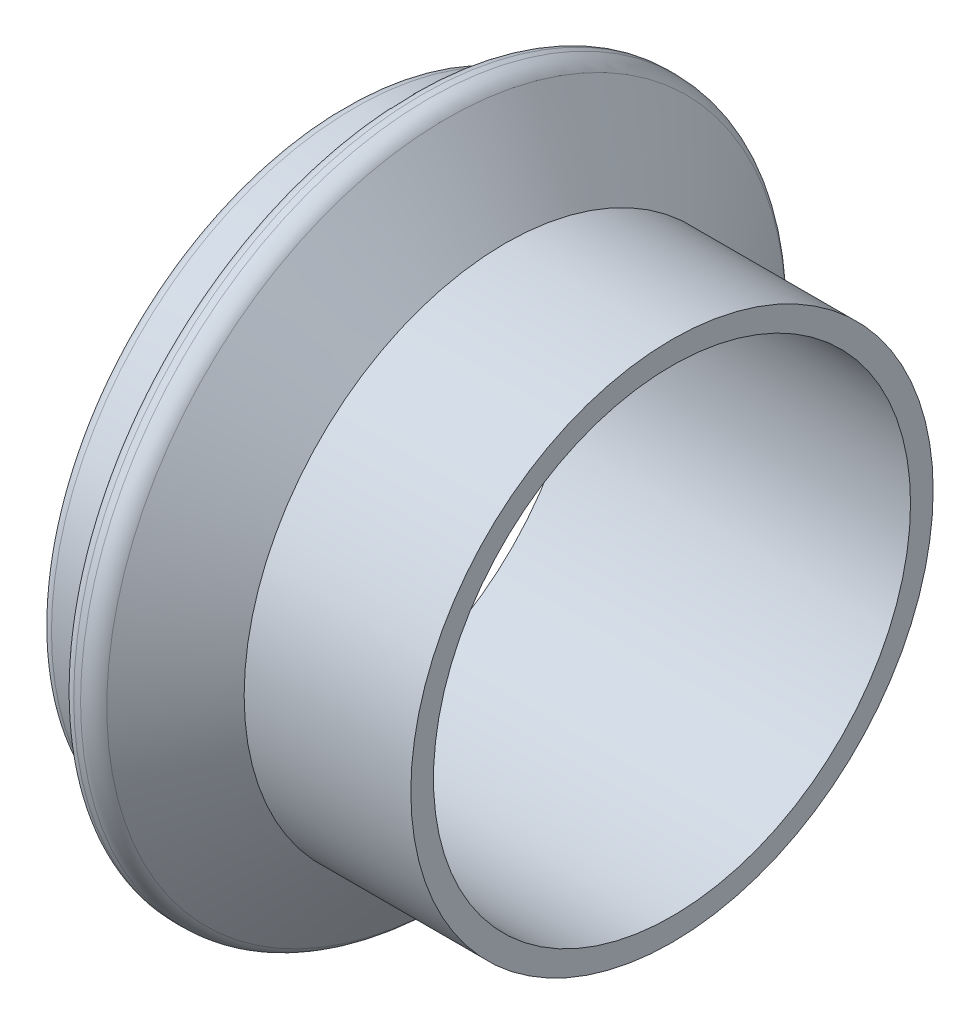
ISO-10303-21;
HEADER;
FILE_DESCRIPTION(('STEP AP214'),'2;1');
FILE_NAME('part.step','',(''),(''),'','','');
FILE_SCHEMA(('AUTOMOTIVE_DESIGN { 1 0 10303 214 1 1 1 1 }'));
ENDSEC;
DATA;
#1=APPLICATION_CONTEXT('core data for automotive mechanical design processes');
#2=APPLICATION_PROTOCOL_DEFINITION('international standard','automotive_design',2000,#1);
#3=PRODUCT_CONTEXT('',#1,'mechanical');
#4=PRODUCT('Part','Part','',(#3));
#5=PRODUCT_RELATED_PRODUCT_CATEGORY('part','',(#4));
#6=PRODUCT_DEFINITION_FORMATION('','',#4);
#7=PRODUCT_DEFINITION_CONTEXT('part definition',#1,'design');
#8=PRODUCT_DEFINITION('design','',#6,#7);
#9=PRODUCT_DEFINITION_SHAPE('','',#8);
#10=(LENGTH_UNIT() NAMED_UNIT(*) SI_UNIT(.MILLI.,.METRE.));
#11=(NAMED_UNIT(*) PLANE_ANGLE_UNIT() SI_UNIT($,.RADIAN.));
#12=(NAMED_UNIT(*) SI_UNIT($,.STERADIAN.) SOLID_ANGLE_UNIT());
#13=UNCERTAINTY_MEASURE_WITH_UNIT(LENGTH_MEASURE(1.E-05),#10,'distance_accuracy_value','');
#14=(GEOMETRIC_REPRESENTATION_CONTEXT(3) GLOBAL_UNCERTAINTY_ASSIGNED_CONTEXT((#13)) GLOBAL_UNIT_ASSIGNED_CONTEXT((#10,
#11,#12)) REPRESENTATION_CONTEXT('',''));
#15=CARTESIAN_POINT('',(0.,0.,0.));
#16=DIRECTION('',(0.,0.,1.));
#17=DIRECTION('',(1.,0.,0.));
#18=AXIS2_PLACEMENT_3D('',#15,#16,#17);
#19=CARTESIAN_POINT('',(0.751416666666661,19.05,0.));
#20=DIRECTION('',(1.,0.,0.));
#21=DIRECTION('',(0.,0.,-1.));
#22=AXIS2_PLACEMENT_3D('',#19,#20,#21);
#23=PLANE('',#22);
#24=CARTESIAN_POINT('',(0.751416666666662,0.,0.));
#25=DIRECTION('',(1.,0.,0.));
#26=DIRECTION('',(0.,0.,-1.));
#27=AXIS2_PLACEMENT_3D('',#24,#25,#26);
#28=CIRCLE('',#27,19.05);
#29=CARTESIAN_POINT('',(0.751416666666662,0.,-19.05));
#30=VERTEX_POINT('',#29);
#31=EDGE_CURVE('E10',#30,#30,#28,.T.);
#32=ORIENTED_EDGE('',*,*,#31,.T.);
#33=EDGE_LOOP('',(#32));
#34=FACE_BOUND('',#33,.T.);
#35=CARTESIAN_POINT('',(0.751416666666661,0.,0.));
#36=DIRECTION('',(1.,0.,0.));
#37=DIRECTION('',(0.,0.,-1.));
#38=AXIS2_PLACEMENT_3D('',#35,#36,#37);
#39=CIRCLE('',#38,17.399);
#40=CARTESIAN_POINT('',(0.751416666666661,0.,-17.399));
#41=VERTEX_POINT('',#40);
#42=EDGE_CURVE('E71',#41,#41,#39,.T.);
#43=ORIENTED_EDGE('',*,*,#42,.F.);
#44=EDGE_LOOP('',(#43));
#45=FACE_BOUND('',#44,.T.);
#46=ADVANCED_FACE('F31',(#34,#45),#23,.T.);
#47=CARTESIAN_POINT('',(0.,0.,0.));
#48=DIRECTION('',(1.,0.,0.));
#49=DIRECTION('',(0.,0.,-1.));
#50=AXIS2_PLACEMENT_3D('',#47,#48,#49);
#51=CYLINDRICAL_SURFACE('',#50,19.05);
#52=CARTESIAN_POINT('',(-11.4053151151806,0.,0.));
#53=DIRECTION('',(1.,0.,0.));
#54=DIRECTION('',(0.,0.,-1.));
#55=AXIS2_PLACEMENT_3D('',#52,#53,#54);
#56=CIRCLE('',#55,19.05);
#57=CARTESIAN_POINT('',(-11.4053151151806,0.,-19.05));
#58=VERTEX_POINT('',#57);
#59=EDGE_CURVE('E37',#58,#58,#56,.T.);
#60=ORIENTED_EDGE('',*,*,#59,.T.);
#61=EDGE_LOOP('',(#60));
#62=FACE_BOUND('',#61,.T.);
#63=ORIENTED_EDGE('',*,*,#31,.F.);
#64=EDGE_LOOP('',(#63));
#65=FACE_BOUND('',#64,.T.);
#66=ADVANCED_FACE('F79',(#62,#65),#51,.T.);
#67=CARTESIAN_POINT('',(-11.4053151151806,0.,0.));
#68=DIRECTION('',(-1.,0.,0.));
#69=DIRECTION('',(0.,0.,1.));
#70=AXIS2_PLACEMENT_3D('',#67,#68,#69);
#71=CONICAL_SURFACE('',#70,19.05,0.925024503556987);
#72=CARTESIAN_POINT('',(-15.7102370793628,0.,0.));
#73=DIRECTION('',(1.,0.,0.));
#74=DIRECTION('',(0.,0.,-1.));
#75=AXIS2_PLACEMENT_3D('',#72,#73,#74);
#76=CIRCLE('',#75,24.7628244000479);
#77=CARTESIAN_POINT('',(-15.7102370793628,0.,-24.7628244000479));
#78=VERTEX_POINT('',#77);
#79=EDGE_CURVE('E41',#78,#78,#76,.T.);
#80=ORIENTED_EDGE('',*,*,#79,.T.);
#81=EDGE_LOOP('',(#80));
#82=FACE_BOUND('',#81,.T.);
#83=ORIENTED_EDGE('',*,*,#59,.F.);
#84=EDGE_LOOP('',(#83));
#85=FACE_BOUND('',#84,.T.);
#86=ADVANCED_FACE('F83',(#82,#85),#71,.T.);
#87=CARTESIAN_POINT('',(-16.9882136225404,0.,0.));
#88=DIRECTION('',(1.,0.,0.));
#89=DIRECTION('',(0.,0.,-1.));
#90=AXIS2_PLACEMENT_3D('',#87,#88,#89);
#91=TOROIDAL_SURFACE('',#90,23.7998,1.60019999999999);
#92=CARTESIAN_POINT('',(-16.9882136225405,0.,0.));
#93=DIRECTION('',(1.,0.,0.));
#94=DIRECTION('',(0.,0.,-1.));
#95=AXIS2_PLACEMENT_3D('',#92,#93,#94);
#96=CIRCLE('',#95,25.4);
#97=CARTESIAN_POINT('',(-16.9882136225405,0.,-25.4));
#98=VERTEX_POINT('',#97);
#99=EDGE_CURVE('E45',#98,#98,#96,.T.);
#100=ORIENTED_EDGE('',*,*,#99,.T.);
#101=EDGE_LOOP('',(#100));
#102=FACE_BOUND('',#101,.T.);
#103=ORIENTED_EDGE('',*,*,#79,.F.);
#104=EDGE_LOOP('',(#103));
#105=FACE_BOUND('',#104,.T.);
#106=ADVANCED_FACE('F87',(#102,#105),#91,.T.);
#107=CARTESIAN_POINT('',(0.,0.,0.));
#108=DIRECTION('',(1.,0.,0.));
#109=DIRECTION('',(0.,0.,-1.));
#110=AXIS2_PLACEMENT_3D('',#107,#108,#109);
#111=CYLINDRICAL_SURFACE('',#110,25.4);
#112=CARTESIAN_POINT('',(-17.4857833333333,0.,0.));
#113=DIRECTION('',(1.,0.,0.));
#114=DIRECTION('',(0.,0.,-1.));
#115=AXIS2_PLACEMENT_3D('',#112,#113,#114);
#116=CIRCLE('',#115,25.4);
#117=CARTESIAN_POINT('',(-17.4857833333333,0.,-25.4));
#118=VERTEX_POINT('',#117);
#119=EDGE_CURVE('E50',#118,#118,#116,.T.);
#120=ORIENTED_EDGE('',*,*,#119,.T.);
#121=EDGE_LOOP('',(#120));
#122=FACE_BOUND('',#121,.T.);
#123=ORIENTED_EDGE('',*,*,#99,.F.);
#124=EDGE_LOOP('',(#123));
#125=FACE_BOUND('',#124,.T.);
#126=ADVANCED_FACE('F94',(#122,#125),#111,.T.);
#127=CARTESIAN_POINT('',(-17.4857833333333,0.,0.));
#128=DIRECTION('',(1.,0.,0.));
#129=DIRECTION('',(0.,0.,-1.));
#130=AXIS2_PLACEMENT_3D('',#127,#128,#129);
#131=TOROIDAL_SURFACE('',#130,24.5872,0.812799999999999);
#132=CARTESIAN_POINT('',(-18.2985833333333,0.,0.));
#133=DIRECTION('',(1.,0.,0.));
#134=DIRECTION('',(0.,0.,-1.));
#135=AXIS2_PLACEMENT_3D('',#132,#133,#134);
#136=CIRCLE('',#135,24.5872);
#137=CARTESIAN_POINT('',(-18.2985833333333,0.,-24.5872));
#138=VERTEX_POINT('',#137);
#139=EDGE_CURVE('E53',#138,#138,#136,.T.);
#140=ORIENTED_EDGE('',*,*,#139,.T.);
#141=EDGE_LOOP('',(#140));
#142=FACE_BOUND('',#141,.T.);
#143=ORIENTED_EDGE('',*,*,#119,.F.);
#144=EDGE_LOOP('',(#143));
#145=FACE_BOUND('',#144,.T.);
#146=ADVANCED_FACE('F98',(#142,#145),#131,.T.);
#147=CARTESIAN_POINT('',(-18.2985833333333,22.8854,0.));
#148=DIRECTION('',(-1.,0.,0.));
#149=DIRECTION('',(0.,0.,1.));
#150=AXIS2_PLACEMENT_3D('',#147,#148,#149);
#151=PLANE('',#150);
#152=CARTESIAN_POINT('',(-18.2985833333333,0.,0.));
#153=DIRECTION('',(1.,0.,0.));
#154=DIRECTION('',(0.,0.,-1.));
#155=AXIS2_PLACEMENT_3D('',#152,#153,#154);
#156=CIRCLE('',#155,22.8854);
#157=CARTESIAN_POINT('',(-18.2985833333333,0.,-22.8854));
#158=VERTEX_POINT('',#157);
#159=EDGE_CURVE('E56',#158,#158,#156,.T.);
#160=ORIENTED_EDGE('',*,*,#159,.T.);
#161=EDGE_LOOP('',(#160));
#162=FACE_BOUND('',#161,.T.);
#163=ORIENTED_EDGE('',*,*,#139,.F.);
#164=EDGE_LOOP('',(#163));
#165=FACE_BOUND('',#164,.T.);
#166=ADVANCED_FACE('F102',(#162,#165),#151,.T.);
#167=CARTESIAN_POINT('',(-19.1113833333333,0.,0.));
#168=DIRECTION('',(1.,0.,0.));
#169=DIRECTION('',(0.,0.,-1.));
#170=AXIS2_PLACEMENT_3D('',#167,#168,#169);
#171=TOROIDAL_SURFACE('',#170,22.8854,0.812799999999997);
#172=CARTESIAN_POINT('',(-19.1113833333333,0.,0.));
#173=DIRECTION('',(1.,0.,0.));
#174=DIRECTION('',(0.,0.,-1.));
#175=AXIS2_PLACEMENT_3D('',#172,#173,#174);
#176=CIRCLE('',#175,22.0726);
#177=CARTESIAN_POINT('',(-19.1113833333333,0.,-22.0726));
#178=VERTEX_POINT('',#177);
#179=EDGE_CURVE('E59',#178,#178,#176,.T.);
#180=ORIENTED_EDGE('',*,*,#179,.T.);
#181=EDGE_LOOP('',(#180));
#182=FACE_BOUND('',#181,.T.);
#183=ORIENTED_EDGE('',*,*,#159,.F.);
#184=EDGE_LOOP('',(#183));
#185=FACE_BOUND('',#184,.T.);
#186=ADVANCED_FACE('F106',(#182,#185),#171,.F.);
#187=CARTESIAN_POINT('',(0.,0.,0.));
#188=DIRECTION('',(1.,0.,0.));
#189=DIRECTION('',(0.,0.,-1.));
#190=AXIS2_PLACEMENT_3D('',#187,#188,#189);
#191=CYLINDRICAL_SURFACE('',#190,22.0726);
#192=CARTESIAN_POINT('',(-22.4387833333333,0.,0.));
#193=DIRECTION('',(1.,0.,0.));
#194=DIRECTION('',(0.,0.,-1.));
#195=AXIS2_PLACEMENT_3D('',#192,#193,#194);
#196=CIRCLE('',#195,22.0726);
#197=CARTESIAN_POINT('',(-22.4387833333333,0.,-22.0726));
#198=VERTEX_POINT('',#197);
#199=EDGE_CURVE('E62',#198,#198,#196,.T.);
#200=ORIENTED_EDGE('',*,*,#199,.T.);
#201=EDGE_LOOP('',(#200));
#202=FACE_BOUND('',#201,.T.);
#203=ORIENTED_EDGE('',*,*,#179,.F.);
#204=EDGE_LOOP('',(#203));
#205=FACE_BOUND('',#204,.T.);
#206=ADVANCED_FACE('F110',(#202,#205),#191,.T.);
#207=CARTESIAN_POINT('',(-22.4387833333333,0.,0.));
#208=DIRECTION('',(1.,0.,0.));
#209=DIRECTION('',(0.,0.,-1.));
#210=AXIS2_PLACEMENT_3D('',#207,#208,#209);
#211=TOROIDAL_SURFACE('',#210,21.2598,0.812800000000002);
#212=CARTESIAN_POINT('',(-23.2515833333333,0.,0.));
#213=DIRECTION('',(1.,0.,0.));
#214=DIRECTION('',(0.,0.,-1.));
#215=AXIS2_PLACEMENT_3D('',#212,#213,#214);
#216=CIRCLE('',#215,21.2598);
#217=CARTESIAN_POINT('',(-23.2515833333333,0.,-21.2598));
#218=VERTEX_POINT('',#217);
#219=EDGE_CURVE('E65',#218,#218,#216,.T.);
#220=ORIENTED_EDGE('',*,*,#219,.T.);
#221=EDGE_LOOP('',(#220));
#222=FACE_BOUND('',#221,.T.);
#223=ORIENTED_EDGE('',*,*,#199,.F.);
#224=EDGE_LOOP('',(#223));
#225=FACE_BOUND('',#224,.T.);
#226=ADVANCED_FACE('F114',(#222,#225),#211,.T.);
#227=CARTESIAN_POINT('',(-23.2515833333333,17.399,0.));
#228=DIRECTION('',(-1.,0.,0.));
#229=DIRECTION('',(0.,0.,1.));
#230=AXIS2_PLACEMENT_3D('',#227,#228,#229);
#231=PLANE('',#230);
#232=CARTESIAN_POINT('',(-23.2515833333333,0.,0.));
#233=DIRECTION('',(1.,0.,0.));
#234=DIRECTION('',(0.,0.,-1.));
#235=AXIS2_PLACEMENT_3D('',#232,#233,#234);
#236=CIRCLE('',#235,17.399);
#237=CARTESIAN_POINT('',(-23.2515833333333,0.,-17.399));
#238=VERTEX_POINT('',#237);
#239=EDGE_CURVE('E68',#238,#238,#236,.T.);
#240=ORIENTED_EDGE('',*,*,#239,.T.);
#241=EDGE_LOOP('',(#240));
#242=FACE_BOUND('',#241,.T.);
#243=ORIENTED_EDGE('',*,*,#219,.F.);
#244=EDGE_LOOP('',(#243));
#245=FACE_BOUND('',#244,.T.);
#246=ADVANCED_FACE('F118',(#242,#245),#231,.T.);
#247=CARTESIAN_POINT('',(0.,0.,0.));
#248=DIRECTION('',(1.,0.,0.));
#249=DIRECTION('',(0.,0.,-1.));
#250=AXIS2_PLACEMENT_3D('',#247,#248,#249);
#251=CYLINDRICAL_SURFACE('',#250,17.399);
#252=ORIENTED_EDGE('',*,*,#42,.T.);
#253=EDGE_LOOP('',(#252));
#254=FACE_BOUND('',#253,.T.);
#255=ORIENTED_EDGE('',*,*,#239,.F.);
#256=EDGE_LOOP('',(#255));
#257=FACE_BOUND('',#256,.T.);
#258=ADVANCED_FACE('F75',(#254,#257),#251,.F.);
#259=CLOSED_SHELL('',(#46,#66,#86,#106,#126,#146,#166,#186,#206,#226,#246,#258));
#260=MANIFOLD_SOLID_BREP('B2',#259);
#261=ADVANCED_BREP_SHAPE_REPRESENTATION('',(#18,#260),#14);
#262=SHAPE_DEFINITION_REPRESENTATION(#9,#261);
ENDSEC;
END-ISO-10303-21;
